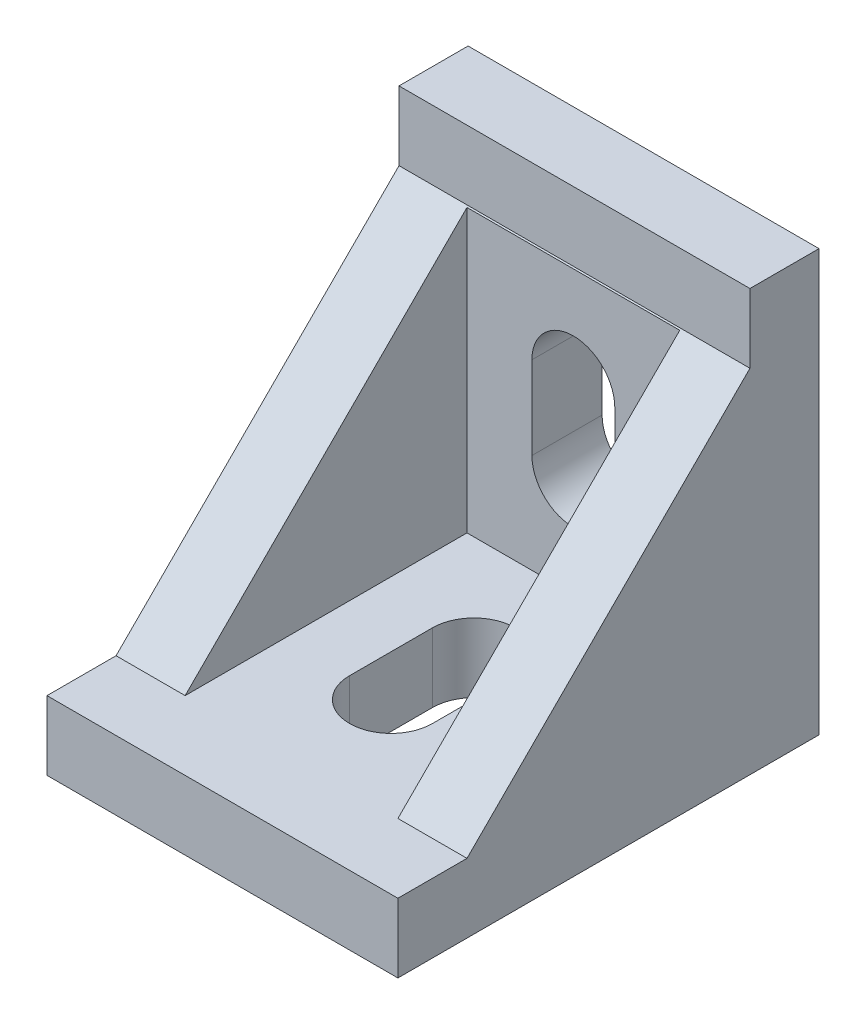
from build123d import *

# Parameters (mm, degrees)
BOSS_EXTRUDE1_DEPTH     = 25.4
SKETCH2_W               = 15.4
SKETCH2_H               = 20.48
CUT_EXTRUDE1_DEPTH      = 25.4
CUT_EXTRUDE2_DEPTH      = 48.109981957
CUT_EXTRUDE2_DEPTH_BACK = 48.109981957
CUT_EXTRUDE3_DEPTH      = 48.153163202
CUT_EXTRUDE3_DEPTH_BACK = 48.153163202


with BuildPart() as part:
    # Sketch1 → Boss-Extrude1 (new body)
    with BuildSketch(Plane(origin=(0, 0, 0), x_dir=(0, 0, -1), z_dir=(1, 0, 0))):
        Polygon((0, 0), (30.48, 0), (30.48, 30.48), (25.48, 30.48), (25.48, 25.48), (5, 5), (0, 5), align=None)
    extrude(amount=BOSS_EXTRUDE1_DEPTH)

    # Sketch2 → Cut-Extrude1 (cut)
    with BuildSketch(Plane.XY):
        with Locations((12.7, 15.24)):
            Rectangle(SKETCH2_W, SKETCH2_H)
    extrude(amount=-CUT_EXTRUDE1_DEPTH, mode=Mode.SUBTRACT)

    # Sketch3 → Cut-Extrude2 (cut, two sides: drawn at the far end of the back side and taken through both)
    with BuildSketch(Plane.XY.offset(-25.4).offset(-CUT_EXTRUDE2_DEPTH_BACK)):
        with BuildLine():
            Line((15.7, 18.2), (15.7, 12.2))
            ThreePointArc((15.7, 12.2), (12.7, 9.2), (9.7, 12.2))
            Line((9.7, 12.2), (9.7, 18.2))
            ThreePointArc((9.7, 18.2), (12.7, 21.2), (15.7, 18.2))
        make_face()
    extrude(amount=CUT_EXTRUDE2_DEPTH + CUT_EXTRUDE2_DEPTH_BACK, mode=Mode.SUBTRACT)

    # Sketch4 → Cut-Extrude3 (cut, two sides: drawn at the far end of the back side and taken through both)
    with BuildSketch(Plane(origin=(0, 5, 0), x_dir=(1, 0, 0), z_dir=(0, 1, 0)).offset(-CUT_EXTRUDE3_DEPTH_BACK)):
        with BuildLine():
            Line((15.7, 18.2), (15.7, 12.2))
            ThreePointArc((15.7, 12.2), (12.7, 9.2), (9.7, 12.2))
            Line((9.7, 12.2), (9.7, 18.2))
            ThreePointArc((9.7, 18.2), (12.7, 21.2), (15.7, 18.2))
        make_face()
    extrude(amount=CUT_EXTRUDE3_DEPTH + CUT_EXTRUDE3_DEPTH_BACK, mode=Mode.SUBTRACT)


solid = part.part
